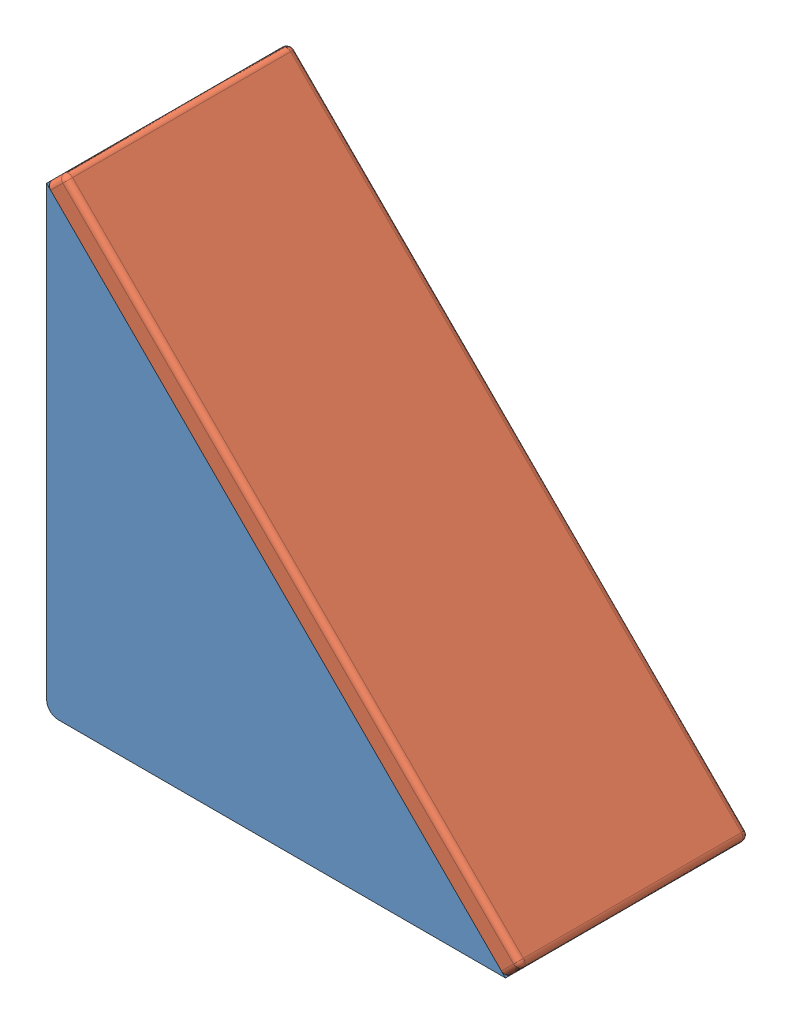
SolidWorks assembly angulo 80x80 con tapa.SLDASM, configuration Predeterminado (file format 3800). Lengths in mm.
Overall size (85.83 85.83 40).
2 component instances, 2 part files, 0 mates.
Components (placement in the parent):
- Angulo 80x80 Triangular-2: Angulo 80x80 Triangular.SLDPRT [Predeterminado] at origin size (83 83 40)
- Tapa angulo 80x80-1: Tapa angulo 80x80.SLDPRT [Predeterminado] at (40 40 20) x (0.707107 -0.707107 0) z (0.707107 0.707107 0) size (113.14 40 4)
